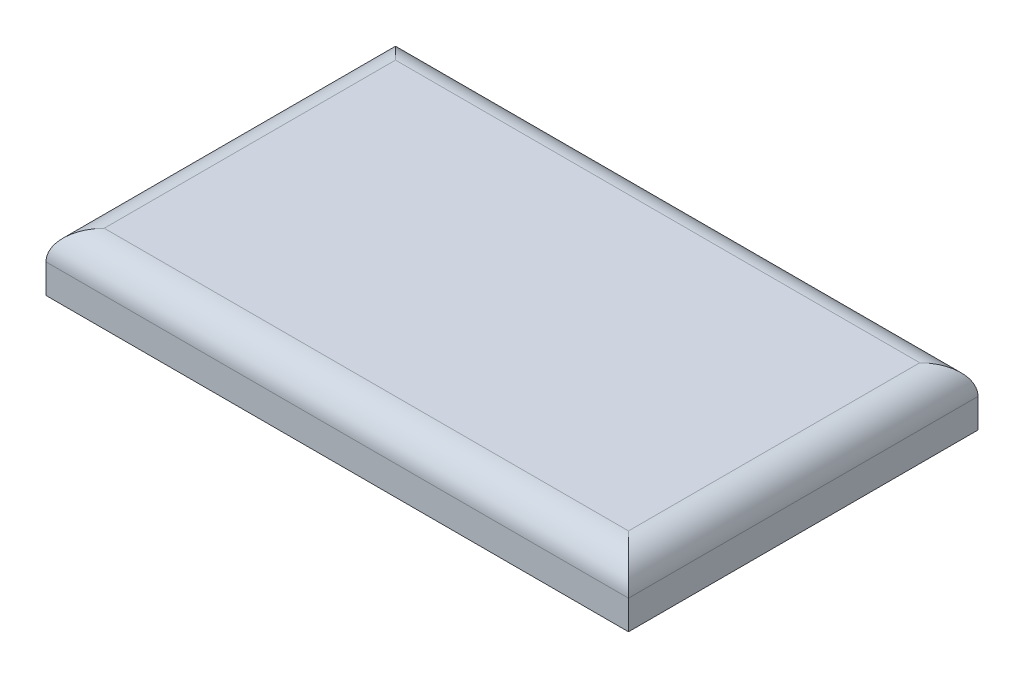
ISO-10303-21;
HEADER;
FILE_DESCRIPTION(('STEP AP214'),'2;1');
FILE_NAME('part.step','',(''),(''),'','','');
FILE_SCHEMA(('AUTOMOTIVE_DESIGN { 1 0 10303 214 1 1 1 1 }'));
ENDSEC;
DATA;
#1=APPLICATION_CONTEXT('core data for automotive mechanical design processes');
#2=APPLICATION_PROTOCOL_DEFINITION('international standard','automotive_design',2000,#1);
#3=PRODUCT_CONTEXT('',#1,'mechanical');
#4=PRODUCT('Part','Part','',(#3));
#5=PRODUCT_RELATED_PRODUCT_CATEGORY('part','',(#4));
#6=PRODUCT_DEFINITION_FORMATION('','',#4);
#7=PRODUCT_DEFINITION_CONTEXT('part definition',#1,'design');
#8=PRODUCT_DEFINITION('design','',#6,#7);
#9=PRODUCT_DEFINITION_SHAPE('','',#8);
#10=(LENGTH_UNIT() NAMED_UNIT(*) SI_UNIT(.MILLI.,.METRE.));
#11=(NAMED_UNIT(*) PLANE_ANGLE_UNIT() SI_UNIT($,.RADIAN.));
#12=(NAMED_UNIT(*) SI_UNIT($,.STERADIAN.) SOLID_ANGLE_UNIT());
#13=UNCERTAINTY_MEASURE_WITH_UNIT(LENGTH_MEASURE(1.E-05),#10,'distance_accuracy_value','');
#14=(GEOMETRIC_REPRESENTATION_CONTEXT(3) GLOBAL_UNCERTAINTY_ASSIGNED_CONTEXT((#13)) GLOBAL_UNIT_ASSIGNED_CONTEXT((#10,
#11,#12)) REPRESENTATION_CONTEXT('',''));
#15=CARTESIAN_POINT('',(0.,0.,0.));
#16=DIRECTION('',(0.,0.,1.));
#17=DIRECTION('',(1.,0.,0.));
#18=AXIS2_PLACEMENT_3D('',#15,#16,#17);
#19=CARTESIAN_POINT('',(50.,10.,30.));
#20=DIRECTION('',(-1.,0.,0.));
#21=DIRECTION('',(0.,0.,1.));
#22=AXIS2_PLACEMENT_3D('',#19,#20,#21);
#23=PLANE('',#22);
#24=DIRECTION('',(0.,-1.,0.));
#25=VECTOR('',#24,1.);
#26=CARTESIAN_POINT('',(50.,10.,-30.));
#27=LINE('',#26,#25);
#28=CARTESIAN_POINT('',(50.,5.,-30.));
#29=VERTEX_POINT('',#28);
#30=CARTESIAN_POINT('',(50.,0.,-30.));
#31=VERTEX_POINT('',#30);
#32=EDGE_CURVE('E86',#29,#31,#27,.T.);
#33=ORIENTED_EDGE('',*,*,#32,.F.);
#34=DIRECTION('',(0.,0.,-1.));
#35=VECTOR('',#34,1.);
#36=CARTESIAN_POINT('',(50.,5.,30.));
#37=LINE('',#36,#35);
#38=CARTESIAN_POINT('',(50.,5.,30.));
#39=VERTEX_POINT('',#38);
#40=EDGE_CURVE('E129',#29,#39,#37,.F.);
#41=ORIENTED_EDGE('',*,*,#40,.T.);
#42=DIRECTION('',(0.,-1.,0.));
#43=VECTOR('',#42,1.);
#44=CARTESIAN_POINT('',(50.,10.,30.));
#45=LINE('',#44,#43);
#46=CARTESIAN_POINT('',(50.,0.,30.));
#47=VERTEX_POINT('',#46);
#48=EDGE_CURVE('E108',#39,#47,#45,.T.);
#49=ORIENTED_EDGE('',*,*,#48,.T.);
#50=DIRECTION('',(0.,0.,-1.));
#51=VECTOR('',#50,1.);
#52=CARTESIAN_POINT('',(50.,0.,30.));
#53=LINE('',#52,#51);
#54=EDGE_CURVE('E104',#47,#31,#53,.T.);
#55=ORIENTED_EDGE('',*,*,#54,.T.);
#56=EDGE_LOOP('',(#33,#41,#49,#55));
#57=FACE_BOUND('',#56,.T.);
#58=ADVANCED_FACE('F33',(#57),#23,.F.);
#59=CARTESIAN_POINT('',(-50.,10.,-30.));
#60=DIRECTION('',(0.,0.,1.));
#61=DIRECTION('',(1.,0.,0.));
#62=AXIS2_PLACEMENT_3D('',#59,#60,#61);
#63=PLANE('',#62);
#64=DIRECTION('',(0.,-1.,0.));
#65=VECTOR('',#64,1.);
#66=CARTESIAN_POINT('',(-50.,10.,-30.));
#67=LINE('',#66,#65);
#68=CARTESIAN_POINT('',(-50.,5.,-30.));
#69=VERTEX_POINT('',#68);
#70=CARTESIAN_POINT('',(-50.,0.,-30.));
#71=VERTEX_POINT('',#70);
#72=EDGE_CURVE('E98',#69,#71,#67,.T.);
#73=ORIENTED_EDGE('',*,*,#72,.F.);
#74=DIRECTION('',(-1.,0.,0.));
#75=VECTOR('',#74,1.);
#76=CARTESIAN_POINT('',(-50.,5.,-30.));
#77=LINE('',#76,#75);
#78=EDGE_CURVE('E92',#69,#29,#77,.F.);
#79=ORIENTED_EDGE('',*,*,#78,.T.);
#80=ORIENTED_EDGE('',*,*,#32,.T.);
#81=DIRECTION('',(-1.,0.,0.));
#82=VECTOR('',#81,1.);
#83=CARTESIAN_POINT('',(-50.,0.,-30.));
#84=LINE('',#83,#82);
#85=EDGE_CURVE('E89',#31,#71,#84,.T.);
#86=ORIENTED_EDGE('',*,*,#85,.T.);
#87=EDGE_LOOP('',(#73,#79,#80,#86));
#88=FACE_BOUND('',#87,.T.);
#89=ADVANCED_FACE('F88',(#88),#63,.F.);
#90=CARTESIAN_POINT('',(-50.,10.,30.));
#91=DIRECTION('',(1.,0.,0.));
#92=DIRECTION('',(0.,0.,-1.));
#93=AXIS2_PLACEMENT_3D('',#90,#91,#92);
#94=PLANE('',#93);
#95=DIRECTION('',(0.,-1.,0.));
#96=VECTOR('',#95,1.);
#97=CARTESIAN_POINT('',(-50.,10.,30.));
#98=LINE('',#97,#96);
#99=CARTESIAN_POINT('',(-50.,5.,30.));
#100=VERTEX_POINT('',#99);
#101=CARTESIAN_POINT('',(-50.,0.,30.));
#102=VERTEX_POINT('',#101);
#103=EDGE_CURVE('E118',#100,#102,#98,.T.);
#104=ORIENTED_EDGE('',*,*,#103,.F.);
#105=DIRECTION('',(0.,0.,1.));
#106=VECTOR('',#105,1.);
#107=CARTESIAN_POINT('',(-50.,5.,30.));
#108=LINE('',#107,#106);
#109=EDGE_CURVE('E42',#100,#69,#108,.F.);
#110=ORIENTED_EDGE('',*,*,#109,.T.);
#111=ORIENTED_EDGE('',*,*,#72,.T.);
#112=DIRECTION('',(0.,0.,1.));
#113=VECTOR('',#112,1.);
#114=CARTESIAN_POINT('',(-50.,0.,30.));
#115=LINE('',#114,#113);
#116=EDGE_CURVE('E106',#71,#102,#115,.T.);
#117=ORIENTED_EDGE('',*,*,#116,.T.);
#118=EDGE_LOOP('',(#104,#110,#111,#117));
#119=FACE_BOUND('',#118,.T.);
#120=ADVANCED_FACE('F153',(#119),#94,.F.);
#121=CARTESIAN_POINT('',(-50.,10.,30.));
#122=DIRECTION('',(0.,0.,-1.));
#123=DIRECTION('',(-1.,0.,0.));
#124=AXIS2_PLACEMENT_3D('',#121,#122,#123);
#125=PLANE('',#124);
#126=ORIENTED_EDGE('',*,*,#48,.F.);
#127=DIRECTION('',(1.,0.,0.));
#128=VECTOR('',#127,1.);
#129=CARTESIAN_POINT('',(-50.,5.,30.));
#130=LINE('',#129,#128);
#131=EDGE_CURVE('E11',#39,#100,#130,.F.);
#132=ORIENTED_EDGE('',*,*,#131,.T.);
#133=ORIENTED_EDGE('',*,*,#103,.T.);
#134=DIRECTION('',(1.,0.,0.));
#135=VECTOR('',#134,1.);
#136=CARTESIAN_POINT('',(-50.,0.,30.));
#137=LINE('',#136,#135);
#138=EDGE_CURVE('E115',#102,#47,#137,.T.);
#139=ORIENTED_EDGE('',*,*,#138,.T.);
#140=EDGE_LOOP('',(#126,#132,#133,#139));
#141=FACE_BOUND('',#140,.T.);
#142=ADVANCED_FACE('F152',(#141),#125,.F.);
#143=CARTESIAN_POINT('',(50.,10.,-30.));
#144=DIRECTION('',(0.,-1.,0.));
#145=DIRECTION('',(0.,0.,-1.));
#146=AXIS2_PLACEMENT_3D('',#143,#144,#145);
#147=PLANE('',#146);
#148=DIRECTION('',(1.,0.,0.));
#149=VECTOR('',#148,1.);
#150=CARTESIAN_POINT('',(50.,10.,25.));
#151=LINE('',#150,#149);
#152=CARTESIAN_POINT('',(-45.,10.,25.));
#153=VERTEX_POINT('',#152);
#154=CARTESIAN_POINT('',(45.,10.,25.));
#155=VERTEX_POINT('',#154);
#156=EDGE_CURVE('E97',#153,#155,#151,.T.);
#157=ORIENTED_EDGE('',*,*,#156,.T.);
#158=DIRECTION('',(0.,0.,-1.));
#159=VECTOR('',#158,1.);
#160=CARTESIAN_POINT('',(45.,10.,-30.));
#161=LINE('',#160,#159);
#162=CARTESIAN_POINT('',(45.,10.,-25.));
#163=VERTEX_POINT('',#162);
#164=EDGE_CURVE('E126',#155,#163,#161,.T.);
#165=ORIENTED_EDGE('',*,*,#164,.T.);
#166=DIRECTION('',(-1.,0.,0.));
#167=VECTOR('',#166,1.);
#168=CARTESIAN_POINT('',(50.,10.,-25.));
#169=LINE('',#168,#167);
#170=CARTESIAN_POINT('',(-45.,10.,-25.));
#171=VERTEX_POINT('',#170);
#172=EDGE_CURVE('E124',#163,#171,#169,.T.);
#173=ORIENTED_EDGE('',*,*,#172,.T.);
#174=DIRECTION('',(0.,0.,1.));
#175=VECTOR('',#174,1.);
#176=CARTESIAN_POINT('',(-45.,10.,-30.));
#177=LINE('',#176,#175);
#178=EDGE_CURVE('E122',#171,#153,#177,.T.);
#179=ORIENTED_EDGE('',*,*,#178,.T.);
#180=EDGE_LOOP('',(#157,#165,#173,#179));
#181=FACE_BOUND('',#180,.T.);
#182=ADVANCED_FACE('F147',(#181),#147,.F.);
#183=CARTESIAN_POINT('',(50.,0.,-30.));
#184=DIRECTION('',(0.,-1.,0.));
#185=DIRECTION('',(0.,0.,-1.));
#186=AXIS2_PLACEMENT_3D('',#183,#184,#185);
#187=PLANE('',#186);
#188=ORIENTED_EDGE('',*,*,#54,.F.);
#189=ORIENTED_EDGE('',*,*,#138,.F.);
#190=ORIENTED_EDGE('',*,*,#116,.F.);
#191=ORIENTED_EDGE('',*,*,#85,.F.);
#192=EDGE_LOOP('',(#188,#189,#190,#191));
#193=FACE_BOUND('',#192,.T.);
#194=ADVANCED_FACE('F102',(#193),#187,.T.);
#195=CARTESIAN_POINT('',(-45.,5.,-30.));
#196=DIRECTION('',(0.,0.,1.));
#197=DIRECTION('',(1.,0.,0.));
#198=AXIS2_PLACEMENT_3D('',#195,#196,#197);
#199=CYLINDRICAL_SURFACE('',#198,5.);
#200=CARTESIAN_POINT('',(-45.,5.,-25.));
#201=DIRECTION('',(-0.707106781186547,0.,0.707106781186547));
#202=DIRECTION('',(0.707106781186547,0.,0.707106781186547));
#203=AXIS2_PLACEMENT_3D('',#200,#201,#202);
#204=ELLIPSE('',#203,7.07106781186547,5.);
#205=EDGE_CURVE('E112',#69,#171,#204,.F.);
#206=ORIENTED_EDGE('',*,*,#205,.F.);
#207=ORIENTED_EDGE('',*,*,#109,.F.);
#208=CARTESIAN_POINT('',(-45.,5.,25.));
#209=DIRECTION('',(0.707106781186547,0.,0.707106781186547));
#210=DIRECTION('',(0.707106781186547,0.,-0.707106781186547));
#211=AXIS2_PLACEMENT_3D('',#208,#209,#210);
#212=ELLIPSE('',#211,7.07106781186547,5.);
#213=EDGE_CURVE('E37',#153,#100,#212,.T.);
#214=ORIENTED_EDGE('',*,*,#213,.F.);
#215=ORIENTED_EDGE('',*,*,#178,.F.);
#216=EDGE_LOOP('',(#206,#207,#214,#215));
#217=FACE_BOUND('',#216,.T.);
#218=ADVANCED_FACE('F35',(#217),#199,.T.);
#219=CARTESIAN_POINT('',(50.,5.,25.));
#220=DIRECTION('',(1.,0.,0.));
#221=DIRECTION('',(0.,0.,-1.));
#222=AXIS2_PLACEMENT_3D('',#219,#220,#221);
#223=CYLINDRICAL_SURFACE('',#222,5.);
#224=ORIENTED_EDGE('',*,*,#213,.T.);
#225=ORIENTED_EDGE('',*,*,#131,.F.);
#226=CARTESIAN_POINT('',(45.,5.,25.));
#227=DIRECTION('',(0.707106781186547,0.,-0.707106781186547));
#228=DIRECTION('',(0.707106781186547,0.,0.707106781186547));
#229=AXIS2_PLACEMENT_3D('',#226,#227,#228);
#230=ELLIPSE('',#229,7.07106781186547,5.);
#231=EDGE_CURVE('E135',#155,#39,#230,.T.);
#232=ORIENTED_EDGE('',*,*,#231,.F.);
#233=ORIENTED_EDGE('',*,*,#156,.F.);
#234=EDGE_LOOP('',(#224,#225,#232,#233));
#235=FACE_BOUND('',#234,.T.);
#236=ADVANCED_FACE('F170',(#235),#223,.T.);
#237=CARTESIAN_POINT('',(50.,5.,-25.));
#238=DIRECTION('',(-1.,0.,0.));
#239=DIRECTION('',(0.,0.,1.));
#240=AXIS2_PLACEMENT_3D('',#237,#238,#239);
#241=CYLINDRICAL_SURFACE('',#240,5.);
#242=ORIENTED_EDGE('',*,*,#205,.T.);
#243=ORIENTED_EDGE('',*,*,#172,.F.);
#244=CARTESIAN_POINT('',(45.,5.,-25.));
#245=DIRECTION('',(-0.707106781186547,0.,-0.707106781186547));
#246=DIRECTION('',(-0.707106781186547,0.,0.707106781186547));
#247=AXIS2_PLACEMENT_3D('',#244,#245,#246);
#248=ELLIPSE('',#247,7.07106781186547,5.);
#249=EDGE_CURVE('E133',#29,#163,#248,.F.);
#250=ORIENTED_EDGE('',*,*,#249,.F.);
#251=ORIENTED_EDGE('',*,*,#78,.F.);
#252=EDGE_LOOP('',(#242,#243,#250,#251));
#253=FACE_BOUND('',#252,.T.);
#254=ADVANCED_FACE('F140',(#253),#241,.T.);
#255=CARTESIAN_POINT('',(45.,5.,-30.));
#256=DIRECTION('',(0.,0.,-1.));
#257=DIRECTION('',(-1.,0.,0.));
#258=AXIS2_PLACEMENT_3D('',#255,#256,#257);
#259=CYLINDRICAL_SURFACE('',#258,5.);
#260=ORIENTED_EDGE('',*,*,#231,.T.);
#261=ORIENTED_EDGE('',*,*,#40,.F.);
#262=ORIENTED_EDGE('',*,*,#249,.T.);
#263=ORIENTED_EDGE('',*,*,#164,.F.);
#264=EDGE_LOOP('',(#260,#261,#262,#263));
#265=FACE_BOUND('',#264,.T.);
#266=ADVANCED_FACE('F151',(#265),#259,.T.);
#267=CLOSED_SHELL('',(#58,#89,#120,#142,#182,#194,#218,#236,#254,#266));
#268=MANIFOLD_SOLID_BREP('B2',#267);
#269=ADVANCED_BREP_SHAPE_REPRESENTATION('',(#18,#268),#14);
#270=SHAPE_DEFINITION_REPRESENTATION(#9,#269);
ENDSEC;
END-ISO-10303-21;
